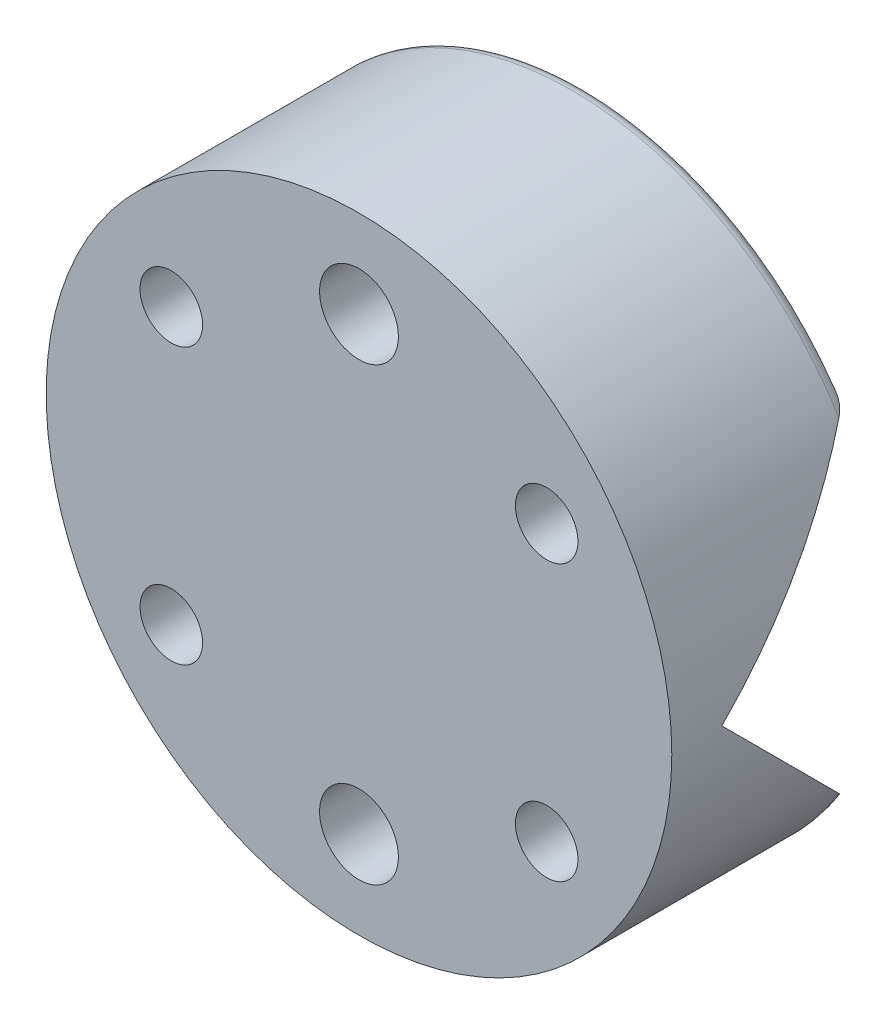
ISO-10303-21;
HEADER;
FILE_DESCRIPTION(('STEP AP214'),'2;1');
FILE_NAME('part.step','',(''),(''),'','','');
FILE_SCHEMA(('AUTOMOTIVE_DESIGN { 1 0 10303 214 1 1 1 1 }'));
ENDSEC;
DATA;
#1=APPLICATION_CONTEXT('core data for automotive mechanical design processes');
#2=APPLICATION_PROTOCOL_DEFINITION('international standard','automotive_design',2000,#1);
#3=PRODUCT_CONTEXT('',#1,'mechanical');
#4=PRODUCT('Part','Part','',(#3));
#5=PRODUCT_RELATED_PRODUCT_CATEGORY('part','',(#4));
#6=PRODUCT_DEFINITION_FORMATION('','',#4);
#7=PRODUCT_DEFINITION_CONTEXT('part definition',#1,'design');
#8=PRODUCT_DEFINITION('design','',#6,#7);
#9=PRODUCT_DEFINITION_SHAPE('','',#8);
#10=(LENGTH_UNIT() NAMED_UNIT(*) SI_UNIT(.MILLI.,.METRE.));
#11=(NAMED_UNIT(*) PLANE_ANGLE_UNIT() SI_UNIT($,.RADIAN.));
#12=(NAMED_UNIT(*) SI_UNIT($,.STERADIAN.) SOLID_ANGLE_UNIT());
#13=UNCERTAINTY_MEASURE_WITH_UNIT(LENGTH_MEASURE(1.E-05),#10,'distance_accuracy_value','');
#14=(GEOMETRIC_REPRESENTATION_CONTEXT(3) GLOBAL_UNCERTAINTY_ASSIGNED_CONTEXT((#13)) GLOBAL_UNIT_ASSIGNED_CONTEXT((#10,
#11,#12)) REPRESENTATION_CONTEXT('',''));
#15=CARTESIAN_POINT('',(0.,0.,0.));
#16=DIRECTION('',(0.,0.,1.));
#17=DIRECTION('',(1.,0.,0.));
#18=AXIS2_PLACEMENT_3D('',#15,#16,#17);
#19=CARTESIAN_POINT('',(0.,0.,0.));
#20=DIRECTION('',(0.,0.,1.));
#21=DIRECTION('',(1.,0.,0.));
#22=AXIS2_PLACEMENT_3D('',#19,#20,#21);
#23=PLANE('',#22);
#24=CARTESIAN_POINT('',(0.,18.,0.));
#25=DIRECTION('',(0.,0.,1.));
#26=DIRECTION('',(1.,0.,0.));
#27=AXIS2_PLACEMENT_3D('',#24,#25,#26);
#28=CIRCLE('',#27,3.15);
#29=CARTESIAN_POINT('',(3.15,18.,0.));
#30=VERTEX_POINT('',#29);
#31=EDGE_CURVE('E241',#30,#30,#28,.T.);
#32=ORIENTED_EDGE('',*,*,#31,.T.);
#33=EDGE_LOOP('',(#32));
#34=FACE_BOUND('',#33,.T.);
#35=DIRECTION('',(-1.,0.,0.));
#36=VECTOR('',#35,1.);
#37=CARTESIAN_POINT('',(0.,14.,0.));
#38=LINE('',#37,#36);
#39=CARTESIAN_POINT('',(19.4935886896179,14.,0.));
#40=VERTEX_POINT('',#39);
#41=CARTESIAN_POINT('',(-19.4935886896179,14.,0.));
#42=VERTEX_POINT('',#41);
#43=EDGE_CURVE('E144',#40,#42,#38,.T.);
#44=ORIENTED_EDGE('',*,*,#43,.T.);
#45=CARTESIAN_POINT('',(0.,0.,0.));
#46=DIRECTION('',(0.,0.,1.));
#47=DIRECTION('',(1.,0.,0.));
#48=AXIS2_PLACEMENT_3D('',#45,#46,#47);
#49=CIRCLE('',#48,24.);
#50=EDGE_CURVE('E11',#42,#40,#49,.F.);
#51=ORIENTED_EDGE('',*,*,#50,.T.);
#52=EDGE_LOOP('',(#44,#51));
#53=FACE_BOUND('',#52,.T.);
#54=ADVANCED_FACE('F33',(#34,#53),#23,.F.);
#55=CARTESIAN_POINT('',(0.,0.,18.));
#56=DIRECTION('',(0.,0.,-1.));
#57=DIRECTION('',(-1.,0.,0.));
#58=AXIS2_PLACEMENT_3D('',#55,#56,#57);
#59=CYLINDRICAL_SURFACE('',#58,25.);
#60=CARTESIAN_POINT('',(0.,0.,18.));
#61=DIRECTION('',(0.,0.,1.));
#62=DIRECTION('',(1.,0.,0.));
#63=AXIS2_PLACEMENT_3D('',#60,#61,#62);
#64=CIRCLE('',#63,25.);
#65=CARTESIAN_POINT('',(25.,0.,18.));
#66=VERTEX_POINT('',#65);
#67=EDGE_CURVE('E138',#66,#66,#64,.T.);
#68=ORIENTED_EDGE('',*,*,#67,.F.);
#69=EDGE_LOOP('',(#68));
#70=FACE_BOUND('',#69,.T.);
#71=CARTESIAN_POINT('',(0.,0.,14.));
#72=DIRECTION('',(0.,-0.707106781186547,0.707106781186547));
#73=DIRECTION('',(0.,-0.707106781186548,-0.707106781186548));
#74=AXIS2_PLACEMENT_3D('',#71,#72,#73);
#75=ELLIPSE('',#74,35.3553390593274,25.);
#76=CARTESIAN_POINT('',(-25.,0.,14.));
#77=VERTEX_POINT('',#76);
#78=CARTESIAN_POINT('',(-21.3541565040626,-13.,0.999999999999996));
#79=VERTEX_POINT('',#78);
#80=EDGE_CURVE('E133',#77,#79,#75,.T.);
#81=ORIENTED_EDGE('',*,*,#80,.T.);
#82=CARTESIAN_POINT('',(0.,0.,1.));
#83=DIRECTION('',(0.,0.,1.));
#84=DIRECTION('',(1.,0.,0.));
#85=AXIS2_PLACEMENT_3D('',#82,#83,#84);
#86=CIRCLE('',#85,25.);
#87=CARTESIAN_POINT('',(21.3541565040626,-13.,0.999999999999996));
#88=VERTEX_POINT('',#87);
#89=EDGE_CURVE('E149',#79,#88,#86,.T.);
#90=ORIENTED_EDGE('',*,*,#89,.T.);
#91=CARTESIAN_POINT('',(0.,0.,14.));
#92=DIRECTION('',(0.,-0.707106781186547,0.707106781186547));
#93=DIRECTION('',(0.,-0.707106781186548,-0.707106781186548));
#94=AXIS2_PLACEMENT_3D('',#91,#92,#93);
#95=ELLIPSE('',#94,35.3553390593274,25.);
#96=CARTESIAN_POINT('',(25.,0.,14.));
#97=VERTEX_POINT('',#96);
#98=EDGE_CURVE('E125',#88,#97,#95,.T.);
#99=ORIENTED_EDGE('',*,*,#98,.T.);
#100=CARTESIAN_POINT('',(0.,0.,14.));
#101=DIRECTION('',(0.,0.707106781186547,0.707106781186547));
#102=DIRECTION('',(0.,0.707106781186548,-0.707106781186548));
#103=AXIS2_PLACEMENT_3D('',#100,#101,#102);
#104=ELLIPSE('',#103,35.3553390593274,25.);
#105=CARTESIAN_POINT('',(21.3541565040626,13.,0.999999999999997));
#106=VERTEX_POINT('',#105);
#107=EDGE_CURVE('E127',#97,#106,#104,.T.);
#108=ORIENTED_EDGE('',*,*,#107,.T.);
#109=CARTESIAN_POINT('',(0.,0.,1.));
#110=DIRECTION('',(0.,0.,1.));
#111=DIRECTION('',(1.,0.,0.));
#112=AXIS2_PLACEMENT_3D('',#109,#110,#111);
#113=CIRCLE('',#112,25.);
#114=CARTESIAN_POINT('',(-21.3541565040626,13.,0.999999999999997));
#115=VERTEX_POINT('',#114);
#116=EDGE_CURVE('E146',#106,#115,#113,.T.);
#117=ORIENTED_EDGE('',*,*,#116,.T.);
#118=CARTESIAN_POINT('',(0.,0.,14.));
#119=DIRECTION('',(0.,0.707106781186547,0.707106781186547));
#120=DIRECTION('',(0.,0.707106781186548,-0.707106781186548));
#121=AXIS2_PLACEMENT_3D('',#118,#119,#120);
#122=ELLIPSE('',#121,35.3553390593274,25.);
#123=EDGE_CURVE('E136',#115,#77,#122,.T.);
#124=ORIENTED_EDGE('',*,*,#123,.T.);
#125=EDGE_LOOP('',(#81,#90,#99,#108,#117,#124));
#126=FACE_BOUND('',#125,.T.);
#127=ADVANCED_FACE('F35',(#70,#126),#59,.T.);
#128=CARTESIAN_POINT('',(0.,0.,18.));
#129=DIRECTION('',(0.,0.,1.));
#130=DIRECTION('',(1.,0.,0.));
#131=AXIS2_PLACEMENT_3D('',#128,#129,#130);
#132=PLANE('',#131);
#133=CARTESIAN_POINT('',(0.,18.,18.));
#134=DIRECTION('',(0.,0.,1.));
#135=DIRECTION('',(1.,0.,0.));
#136=AXIS2_PLACEMENT_3D('',#133,#134,#135);
#137=CIRCLE('',#136,3.15);
#138=CARTESIAN_POINT('',(3.15,18.,18.));
#139=VERTEX_POINT('',#138);
#140=EDGE_CURVE('E242',#139,#139,#137,.T.);
#141=ORIENTED_EDGE('',*,*,#140,.F.);
#142=EDGE_LOOP('',(#141));
#143=FACE_BOUND('',#142,.T.);
#144=CARTESIAN_POINT('',(0.,-18.,18.));
#145=DIRECTION('',(0.,0.,1.));
#146=DIRECTION('',(1.,0.,0.));
#147=AXIS2_PLACEMENT_3D('',#144,#145,#146);
#148=CIRCLE('',#147,3.15);
#149=CARTESIAN_POINT('',(3.15,-18.,18.));
#150=VERTEX_POINT('',#149);
#151=EDGE_CURVE('E104',#150,#150,#148,.T.);
#152=ORIENTED_EDGE('',*,*,#151,.F.);
#153=EDGE_LOOP('',(#152));
#154=FACE_BOUND('',#153,.T.);
#155=CARTESIAN_POINT('',(-15.,-11.,18.));
#156=DIRECTION('',(0.,0.,1.));
#157=DIRECTION('',(1.,0.,0.));
#158=AXIS2_PLACEMENT_3D('',#155,#156,#157);
#159=CIRCLE('',#158,2.5);
#160=CARTESIAN_POINT('',(-12.5,-11.,18.));
#161=VERTEX_POINT('',#160);
#162=EDGE_CURVE('E110',#161,#161,#159,.T.);
#163=ORIENTED_EDGE('',*,*,#162,.F.);
#164=EDGE_LOOP('',(#163));
#165=FACE_BOUND('',#164,.T.);
#166=CARTESIAN_POINT('',(-15.,11.,18.));
#167=DIRECTION('',(0.,0.,1.));
#168=DIRECTION('',(1.,0.,0.));
#169=AXIS2_PLACEMENT_3D('',#166,#167,#168);
#170=CIRCLE('',#169,2.5);
#171=CARTESIAN_POINT('',(-12.5,11.,18.));
#172=VERTEX_POINT('',#171);
#173=EDGE_CURVE('E113',#172,#172,#170,.T.);
#174=ORIENTED_EDGE('',*,*,#173,.F.);
#175=EDGE_LOOP('',(#174));
#176=FACE_BOUND('',#175,.T.);
#177=CARTESIAN_POINT('',(15.,-11.,18.));
#178=DIRECTION('',(0.,0.,1.));
#179=DIRECTION('',(1.,0.,0.));
#180=AXIS2_PLACEMENT_3D('',#177,#178,#179);
#181=CIRCLE('',#180,2.5);
#182=CARTESIAN_POINT('',(17.5,-11.,18.));
#183=VERTEX_POINT('',#182);
#184=EDGE_CURVE('E116',#183,#183,#181,.T.);
#185=ORIENTED_EDGE('',*,*,#184,.F.);
#186=EDGE_LOOP('',(#185));
#187=FACE_BOUND('',#186,.T.);
#188=CARTESIAN_POINT('',(15.,11.,18.));
#189=DIRECTION('',(0.,0.,1.));
#190=DIRECTION('',(1.,0.,0.));
#191=AXIS2_PLACEMENT_3D('',#188,#189,#190);
#192=CIRCLE('',#191,2.5);
#193=CARTESIAN_POINT('',(17.5,11.,18.));
#194=VERTEX_POINT('',#193);
#195=EDGE_CURVE('E122',#194,#194,#192,.T.);
#196=ORIENTED_EDGE('',*,*,#195,.F.);
#197=EDGE_LOOP('',(#196));
#198=FACE_BOUND('',#197,.T.);
#199=ORIENTED_EDGE('',*,*,#67,.T.);
#200=EDGE_LOOP('',(#199));
#201=FACE_BOUND('',#200,.T.);
#202=ADVANCED_FACE('F212',(#143,#154,#165,#176,#187,#198,#201),#132,.T.);
#203=CARTESIAN_POINT('',(0.,-18.,0.));
#204=DIRECTION('',(0.,0.,1.));
#205=DIRECTION('',(1.,0.,0.));
#206=AXIS2_PLACEMENT_3D('',#203,#204,#205);
#207=CIRCLE('',#206,3.15);
#208=CARTESIAN_POINT('',(3.15,-18.,0.));
#209=VERTEX_POINT('',#208);
#210=EDGE_CURVE('E98',#209,#209,#207,.T.);
#211=ORIENTED_EDGE('',*,*,#210,.T.);
#212=EDGE_LOOP('',(#211));
#213=FACE_BOUND('',#212,.T.);
#214=DIRECTION('',(1.,0.,0.));
#215=VECTOR('',#214,1.);
#216=CARTESIAN_POINT('',(0.,-14.,0.));
#217=LINE('',#216,#215);
#218=CARTESIAN_POINT('',(-19.4935886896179,-14.,0.));
#219=VERTEX_POINT('',#218);
#220=CARTESIAN_POINT('',(19.4935886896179,-14.,0.));
#221=VERTEX_POINT('',#220);
#222=EDGE_CURVE('E141',#219,#221,#217,.T.);
#223=ORIENTED_EDGE('',*,*,#222,.T.);
#224=CARTESIAN_POINT('',(0.,0.,0.));
#225=DIRECTION('',(0.,0.,1.));
#226=DIRECTION('',(1.,0.,0.));
#227=AXIS2_PLACEMENT_3D('',#224,#225,#226);
#228=CIRCLE('',#227,24.);
#229=EDGE_CURVE('E225',#221,#219,#228,.F.);
#230=ORIENTED_EDGE('',*,*,#229,.T.);
#231=EDGE_LOOP('',(#223,#230));
#232=FACE_BOUND('',#231,.T.);
#233=ADVANCED_FACE('F183',(#213,#232),#23,.F.);
#234=CARTESIAN_POINT('',(-25.,14.,0.));
#235=DIRECTION('',(0.,0.707106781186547,0.707106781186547));
#236=DIRECTION('',(0.,-0.707106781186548,0.707106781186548));
#237=AXIS2_PLACEMENT_3D('',#234,#235,#236);
#238=PLANE('',#237);
#239=ORIENTED_EDGE('',*,*,#123,.F.);
#240=CARTESIAN_POINT('',(-21.3541565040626,13.,1.));
#241=CARTESIAN_POINT('',(-21.3281749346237,13.0426274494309,0.957372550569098));
#242=CARTESIAN_POINT('',(-21.2994248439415,13.0843766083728,0.915623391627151));
#243=CARTESIAN_POINT('',(-21.2370046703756,13.1659499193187,0.834050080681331));
#244=CARTESIAN_POINT('',(-21.2033390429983,13.2057757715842,0.794224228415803));
#245=CARTESIAN_POINT('',(-21.1316564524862,13.2834107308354,0.716589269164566));
#246=CARTESIAN_POINT('',(-21.0936395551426,13.3212198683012,0.678780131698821));
#247=CARTESIAN_POINT('',(-21.0136691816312,13.3946904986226,0.605309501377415));
#248=CARTESIAN_POINT('',(-20.9717146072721,13.4303513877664,0.569648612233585));
#249=CARTESIAN_POINT('',(-20.8373042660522,13.5363809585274,0.463619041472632));
#250=CARTESIAN_POINT('',(-20.7388417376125,13.6030633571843,0.396936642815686));
#251=CARTESIAN_POINT('',(-20.5811490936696,13.6943682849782,0.305631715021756));
#252=CARTESIAN_POINT('',(-20.526855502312,13.7233762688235,0.276623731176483));
#253=CARTESIAN_POINT('',(-20.4150845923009,13.7781424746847,0.221857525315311));
#254=CARTESIAN_POINT('',(-20.3576084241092,13.8039018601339,0.196098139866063));
#255=CARTESIAN_POINT('',(-20.2185784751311,13.8602707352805,0.139729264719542));
#256=CARTESIAN_POINT('',(-20.1357504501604,13.8893317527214,0.110668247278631));
#257=CARTESIAN_POINT('',(-19.9654557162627,13.9388540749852,0.0611459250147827));
#258=CARTESIAN_POINT('',(-19.8780170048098,13.9593617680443,0.040638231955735));
#259=CARTESIAN_POINT('',(-19.7404698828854,13.9822966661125,0.0177033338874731));
#260=CARTESIAN_POINT('',(-19.6916988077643,13.9887013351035,0.0112986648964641));
#261=CARTESIAN_POINT('',(-19.5931999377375,13.9975447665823,0.00245523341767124));
#262=CARTESIAN_POINT('',(-19.5434684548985,13.9999624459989,3.75540011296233E-05));
#263=CARTESIAN_POINT('',(-19.4935886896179,14.,0.));
#264=B_SPLINE_CURVE_WITH_KNOTS('',3,(#240,#241,#242,#243,#244,#245,#246,#247,#248,#249,#250,
#251,#252,#253,#254,#255,#256,#257,#258,#259,#260,#261,#262,#263),.UNSPECIFIED.,.F.,.F.,(4,2,2,
2,2,2,2,2,2,2,2,4),(0.,0.196797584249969,0.393417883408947,0.590035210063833,0.78670753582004,
1.19379782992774,1.3977760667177,1.60168104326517,1.87833417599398,2.15346675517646,
2.30199214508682,2.45130044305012),.UNSPECIFIED.);
#265=EDGE_CURVE('E41',#115,#42,#264,.T.);
#266=ORIENTED_EDGE('',*,*,#265,.T.);
#267=ORIENTED_EDGE('',*,*,#43,.F.);
#268=CARTESIAN_POINT('',(19.4935886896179,14.,0.));
#269=CARTESIAN_POINT('',(19.5366338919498,13.9999779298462,2.20701537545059E-05));
#270=CARTESIAN_POINT('',(19.5796006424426,13.9981688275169,0.00183117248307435));
#271=CARTESIAN_POINT('',(19.6649379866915,13.991475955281,0.00852404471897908));
#272=CARTESIAN_POINT('',(19.7073099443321,13.9866010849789,0.0133989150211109));
#273=CARTESIAN_POINT('',(19.7908518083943,13.974331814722,0.0256681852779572));
#274=CARTESIAN_POINT('',(19.8320294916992,13.9669630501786,0.0330369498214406));
#275=CARTESIAN_POINT('',(19.9135038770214,13.9500279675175,0.0499720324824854));
#276=CARTESIAN_POINT('',(19.9537996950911,13.9404595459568,0.0595404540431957));
#277=CARTESIAN_POINT('',(20.0500429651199,13.914991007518,0.0850089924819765));
#278=CARTESIAN_POINT('',(20.1054769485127,13.8981174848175,0.101882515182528));
#279=CARTESIAN_POINT('',(20.2141172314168,13.8610801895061,0.138919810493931));
#280=CARTESIAN_POINT('',(20.2673217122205,13.840913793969,0.159086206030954));
#281=CARTESIAN_POINT('',(20.4239596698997,13.775880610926,0.224119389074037));
#282=CARTESIAN_POINT('',(20.5238196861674,13.7266468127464,0.273353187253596));
#283=CARTESIAN_POINT('',(20.7170671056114,13.6164862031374,0.38351379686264));
#284=CARTESIAN_POINT('',(20.8099612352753,13.5551330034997,0.44486699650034));
#285=CARTESIAN_POINT('',(20.9822421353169,13.4239716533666,0.576028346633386));
#286=CARTESIAN_POINT('',(21.0616811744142,13.3541981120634,0.645801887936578));
#287=CARTESIAN_POINT('',(21.1762709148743,13.2365250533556,0.763474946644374));
#288=CARTESIAN_POINT('',(21.2164265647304,13.1910399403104,0.808960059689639));
#289=CARTESIAN_POINT('',(21.2903376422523,13.0974370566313,0.902562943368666));
#290=CARTESIAN_POINT('',(21.3240810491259,13.0493145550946,0.950685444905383));
#291=CARTESIAN_POINT('',(21.3541565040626,13.,1.));
#292=B_SPLINE_CURVE_WITH_KNOTS('',3,(#268,#269,#270,#271,#272,#273,#274,#275,#276,#277,#278,
#279,#280,#281,#282,#283,#284,#285,#286,#287,#288,#289,#290,#291),.UNSPECIFIED.,.F.,.F.,(4,2,2,
2,2,2,2,2,2,2,2,4),(0.,0.128950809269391,0.257529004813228,0.384823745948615,0.512240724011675,
0.693025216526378,0.873954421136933,1.23771959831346,1.61784925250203,1.99646655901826,
2.22363418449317,2.45122355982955),.UNSPECIFIED.);
#293=EDGE_CURVE('E186',#40,#106,#292,.T.);
#294=ORIENTED_EDGE('',*,*,#293,.T.);
#295=ORIENTED_EDGE('',*,*,#107,.F.);
#296=DIRECTION('',(1.,0.,0.));
#297=VECTOR('',#296,1.);
#298=CARTESIAN_POINT('',(-25.,0.,14.));
#299=LINE('',#298,#297);
#300=EDGE_CURVE('E130',#77,#97,#299,.T.);
#301=ORIENTED_EDGE('',*,*,#300,.F.);
#302=EDGE_LOOP('',(#239,#266,#267,#294,#295,#301));
#303=FACE_BOUND('',#302,.T.);
#304=ADVANCED_FACE('F176',(#303),#238,.F.);
#305=CARTESIAN_POINT('',(-25.,0.,14.));
#306=DIRECTION('',(0.,-0.707106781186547,0.707106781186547));
#307=DIRECTION('',(0.,-0.707106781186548,-0.707106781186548));
#308=AXIS2_PLACEMENT_3D('',#305,#306,#307);
#309=PLANE('',#308);
#310=ORIENTED_EDGE('',*,*,#98,.F.);
#311=CARTESIAN_POINT('',(21.3541565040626,-13.,1.));
#312=CARTESIAN_POINT('',(21.3281749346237,-13.0426274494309,0.957372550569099));
#313=CARTESIAN_POINT('',(21.2994248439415,-13.0843766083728,0.915623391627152));
#314=CARTESIAN_POINT('',(21.2370046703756,-13.1659499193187,0.834050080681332));
#315=CARTESIAN_POINT('',(21.2033390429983,-13.2057757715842,0.794224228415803));
#316=CARTESIAN_POINT('',(21.1316564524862,-13.2834107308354,0.716589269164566));
#317=CARTESIAN_POINT('',(21.0936395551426,-13.3212198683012,0.678780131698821));
#318=CARTESIAN_POINT('',(21.0136691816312,-13.3946904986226,0.605309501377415));
#319=CARTESIAN_POINT('',(20.9717146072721,-13.4303513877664,0.569648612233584));
#320=CARTESIAN_POINT('',(20.8373042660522,-13.5363809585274,0.46361904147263));
#321=CARTESIAN_POINT('',(20.7388417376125,-13.6030633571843,0.396936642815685));
#322=CARTESIAN_POINT('',(20.5811490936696,-13.6943682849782,0.305631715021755));
#323=CARTESIAN_POINT('',(20.526855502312,-13.7233762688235,0.276623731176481));
#324=CARTESIAN_POINT('',(20.4150845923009,-13.7781424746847,0.221857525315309));
#325=CARTESIAN_POINT('',(20.3576084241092,-13.8039018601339,0.196098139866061));
#326=CARTESIAN_POINT('',(20.2185784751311,-13.8602707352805,0.139729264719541));
#327=CARTESIAN_POINT('',(20.1357504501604,-13.8893317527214,0.110668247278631));
#328=CARTESIAN_POINT('',(19.9654557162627,-13.9388540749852,0.0611459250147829));
#329=CARTESIAN_POINT('',(19.8780170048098,-13.9593617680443,0.0406382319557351));
#330=CARTESIAN_POINT('',(19.7404698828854,-13.9822966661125,0.0177033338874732));
#331=CARTESIAN_POINT('',(19.6916988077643,-13.9887013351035,0.0112986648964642));
#332=CARTESIAN_POINT('',(19.5931999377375,-13.9975447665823,0.00245523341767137));
#333=CARTESIAN_POINT('',(19.5434684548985,-13.9999624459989,3.75540011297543E-05));
#334=CARTESIAN_POINT('',(19.4935886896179,-14.,0.));
#335=B_SPLINE_CURVE_WITH_KNOTS('',3,(#311,#312,#313,#314,#315,#316,#317,#318,#319,#320,#321,
#322,#323,#324,#325,#326,#327,#328,#329,#330,#331,#332,#333,#334),.UNSPECIFIED.,.F.,.F.,(4,2,2,
2,2,2,2,2,2,2,2,4),(0.,0.196797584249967,0.393417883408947,0.590035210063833,0.786707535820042,
1.19379782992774,1.3977760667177,1.60168104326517,1.87833417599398,2.15346675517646,
2.30199214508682,2.45130044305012),.UNSPECIFIED.);
#336=EDGE_CURVE('E160',#88,#221,#335,.T.);
#337=ORIENTED_EDGE('',*,*,#336,.T.);
#338=ORIENTED_EDGE('',*,*,#222,.F.);
#339=CARTESIAN_POINT('',(-19.4935886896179,-14.,0.));
#340=CARTESIAN_POINT('',(-19.5366338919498,-13.9999779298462,2.20701537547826E-05));
#341=CARTESIAN_POINT('',(-19.5796006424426,-13.9981688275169,0.00183117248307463));
#342=CARTESIAN_POINT('',(-19.6649379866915,-13.991475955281,0.00852404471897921));
#343=CARTESIAN_POINT('',(-19.7073099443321,-13.9866010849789,0.0133989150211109));
#344=CARTESIAN_POINT('',(-19.7908518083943,-13.974331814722,0.0256681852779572));
#345=CARTESIAN_POINT('',(-19.8320294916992,-13.9669630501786,0.0330369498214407));
#346=CARTESIAN_POINT('',(-19.9135038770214,-13.9500279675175,0.0499720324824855));
#347=CARTESIAN_POINT('',(-19.9537996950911,-13.9404595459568,0.0595404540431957));
#348=CARTESIAN_POINT('',(-20.0500429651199,-13.914991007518,0.0850089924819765));
#349=CARTESIAN_POINT('',(-20.1054769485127,-13.8981174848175,0.101882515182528));
#350=CARTESIAN_POINT('',(-20.2141172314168,-13.8610801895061,0.138919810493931));
#351=CARTESIAN_POINT('',(-20.2673217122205,-13.840913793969,0.159086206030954));
#352=CARTESIAN_POINT('',(-20.4239596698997,-13.775880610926,0.224119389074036));
#353=CARTESIAN_POINT('',(-20.5238196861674,-13.7266468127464,0.273353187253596));
#354=CARTESIAN_POINT('',(-20.7170671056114,-13.6164862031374,0.38351379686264));
#355=CARTESIAN_POINT('',(-20.8099612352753,-13.5551330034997,0.444866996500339));
#356=CARTESIAN_POINT('',(-20.9822421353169,-13.4239716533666,0.576028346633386));
#357=CARTESIAN_POINT('',(-21.0616811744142,-13.3541981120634,0.64580188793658));
#358=CARTESIAN_POINT('',(-21.1762709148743,-13.2365250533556,0.763474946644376));
#359=CARTESIAN_POINT('',(-21.2164265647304,-13.1910399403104,0.808960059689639));
#360=CARTESIAN_POINT('',(-21.2903376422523,-13.0974370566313,0.902562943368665));
#361=CARTESIAN_POINT('',(-21.3240810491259,-13.0493145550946,0.950685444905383));
#362=CARTESIAN_POINT('',(-21.3541565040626,-13.,1.));
#363=B_SPLINE_CURVE_WITH_KNOTS('',3,(#339,#340,#341,#342,#343,#344,#345,#346,#347,#348,#349,
#350,#351,#352,#353,#354,#355,#356,#357,#358,#359,#360,#361,#362),.UNSPECIFIED.,.F.,.F.,(4,2,2,
2,2,2,2,2,2,2,2,4),(0.,0.128950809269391,0.257529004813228,0.384823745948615,0.512240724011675,
0.693025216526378,0.873954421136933,1.23771959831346,1.61784925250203,1.99646655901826,
2.22363418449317,2.45122355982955),.UNSPECIFIED.);
#364=EDGE_CURVE('E152',#219,#79,#363,.T.);
#365=ORIENTED_EDGE('',*,*,#364,.T.);
#366=ORIENTED_EDGE('',*,*,#80,.F.);
#367=ORIENTED_EDGE('',*,*,#300,.T.);
#368=EDGE_LOOP('',(#310,#337,#338,#365,#366,#367));
#369=FACE_BOUND('',#368,.T.);
#370=ADVANCED_FACE('F170',(#369),#309,.F.);
#371=CARTESIAN_POINT('',(15.,11.,8.00000000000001));
#372=DIRECTION('',(0.,0.,1.));
#373=DIRECTION('',(1.,0.,0.));
#374=AXIS2_PLACEMENT_3D('',#371,#372,#373);
#375=CYLINDRICAL_SURFACE('',#374,2.5);
#376=CARTESIAN_POINT('',(15.,11.,8.00000000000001));
#377=DIRECTION('',(0.,0.,1.));
#378=DIRECTION('',(1.,0.,0.));
#379=AXIS2_PLACEMENT_3D('',#376,#377,#378);
#380=CIRCLE('',#379,2.5);
#381=CARTESIAN_POINT('',(17.5,11.,8.00000000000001));
#382=VERTEX_POINT('',#381);
#383=EDGE_CURVE('E119',#382,#382,#380,.T.);
#384=ORIENTED_EDGE('',*,*,#383,.F.);
#385=EDGE_LOOP('',(#384));
#386=FACE_BOUND('',#385,.T.);
#387=ORIENTED_EDGE('',*,*,#195,.T.);
#388=EDGE_LOOP('',(#387));
#389=FACE_BOUND('',#388,.T.);
#390=ADVANCED_FACE('F175',(#386,#389),#375,.F.);
#391=CARTESIAN_POINT('',(15.,11.,8.00000000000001));
#392=DIRECTION('',(0.,0.,1.));
#393=DIRECTION('',(1.,0.,0.));
#394=AXIS2_PLACEMENT_3D('',#391,#392,#393);
#395=CONICAL_SURFACE('',#394,2.5,1.0471975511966);
#396=CARTESIAN_POINT('',(15.,11.,6.55662432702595));
#397=VERTEX_POINT('',#396);
#398=VERTEX_LOOP('',#397);
#399=FACE_BOUND('',#398,.T.);
#400=ORIENTED_EDGE('',*,*,#383,.T.);
#401=EDGE_LOOP('',(#400));
#402=FACE_BOUND('',#401,.T.);
#403=ADVANCED_FACE('F260',(#399,#402),#395,.F.);
#404=CARTESIAN_POINT('',(15.,-11.,8.00000000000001));
#405=DIRECTION('',(0.,0.,1.));
#406=DIRECTION('',(1.,0.,0.));
#407=AXIS2_PLACEMENT_3D('',#404,#405,#406);
#408=CYLINDRICAL_SURFACE('',#407,2.5);
#409=CARTESIAN_POINT('',(15.,-11.,8.00000000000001));
#410=DIRECTION('',(0.,0.,1.));
#411=DIRECTION('',(1.,0.,0.));
#412=AXIS2_PLACEMENT_3D('',#409,#410,#411);
#413=CIRCLE('',#412,2.5);
#414=CARTESIAN_POINT('',(17.5,-11.,8.00000000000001));
#415=VERTEX_POINT('',#414);
#416=EDGE_CURVE('E95',#415,#415,#413,.T.);
#417=ORIENTED_EDGE('',*,*,#416,.F.);
#418=EDGE_LOOP('',(#417));
#419=FACE_BOUND('',#418,.T.);
#420=ORIENTED_EDGE('',*,*,#184,.T.);
#421=EDGE_LOOP('',(#420));
#422=FACE_BOUND('',#421,.T.);
#423=ADVANCED_FACE('F265',(#419,#422),#408,.F.);
#424=CARTESIAN_POINT('',(-15.,11.,8.00000000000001));
#425=DIRECTION('',(0.,0.,1.));
#426=DIRECTION('',(1.,0.,0.));
#427=AXIS2_PLACEMENT_3D('',#424,#425,#426);
#428=CYLINDRICAL_SURFACE('',#427,2.5);
#429=CARTESIAN_POINT('',(-15.,11.,8.00000000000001));
#430=DIRECTION('',(0.,0.,1.));
#431=DIRECTION('',(1.,0.,0.));
#432=AXIS2_PLACEMENT_3D('',#429,#430,#431);
#433=CIRCLE('',#432,2.5);
#434=CARTESIAN_POINT('',(-12.5,11.,8.00000000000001));
#435=VERTEX_POINT('',#434);
#436=EDGE_CURVE('E101',#435,#435,#433,.T.);
#437=ORIENTED_EDGE('',*,*,#436,.F.);
#438=EDGE_LOOP('',(#437));
#439=FACE_BOUND('',#438,.T.);
#440=ORIENTED_EDGE('',*,*,#173,.T.);
#441=EDGE_LOOP('',(#440));
#442=FACE_BOUND('',#441,.T.);
#443=ADVANCED_FACE('F272',(#439,#442),#428,.F.);
#444=CARTESIAN_POINT('',(-15.,-11.,8.00000000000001));
#445=DIRECTION('',(0.,0.,1.));
#446=DIRECTION('',(1.,0.,0.));
#447=AXIS2_PLACEMENT_3D('',#444,#445,#446);
#448=CYLINDRICAL_SURFACE('',#447,2.5);
#449=CARTESIAN_POINT('',(-15.,-11.,8.00000000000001));
#450=DIRECTION('',(0.,0.,1.));
#451=DIRECTION('',(1.,0.,0.));
#452=AXIS2_PLACEMENT_3D('',#449,#450,#451);
#453=CIRCLE('',#452,2.5);
#454=CARTESIAN_POINT('',(-12.5,-11.,8.00000000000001));
#455=VERTEX_POINT('',#454);
#456=EDGE_CURVE('E97',#455,#455,#453,.T.);
#457=ORIENTED_EDGE('',*,*,#456,.F.);
#458=EDGE_LOOP('',(#457));
#459=FACE_BOUND('',#458,.T.);
#460=ORIENTED_EDGE('',*,*,#162,.T.);
#461=EDGE_LOOP('',(#460));
#462=FACE_BOUND('',#461,.T.);
#463=ADVANCED_FACE('F277',(#459,#462),#448,.F.);
#464=CARTESIAN_POINT('',(-15.,11.,8.00000000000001));
#465=DIRECTION('',(0.,0.,1.));
#466=DIRECTION('',(1.,0.,0.));
#467=AXIS2_PLACEMENT_3D('',#464,#465,#466);
#468=CONICAL_SURFACE('',#467,2.5,1.0471975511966);
#469=CARTESIAN_POINT('',(-15.,11.,6.55662432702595));
#470=VERTEX_POINT('',#469);
#471=VERTEX_LOOP('',#470);
#472=FACE_BOUND('',#471,.T.);
#473=ORIENTED_EDGE('',*,*,#436,.T.);
#474=EDGE_LOOP('',(#473));
#475=FACE_BOUND('',#474,.T.);
#476=ADVANCED_FACE('F281',(#472,#475),#468,.F.);
#477=CARTESIAN_POINT('',(-15.,-11.,8.00000000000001));
#478=DIRECTION('',(0.,0.,1.));
#479=DIRECTION('',(1.,0.,0.));
#480=AXIS2_PLACEMENT_3D('',#477,#478,#479);
#481=CONICAL_SURFACE('',#480,2.5,1.0471975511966);
#482=CARTESIAN_POINT('',(-15.,-11.,6.55662432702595));
#483=VERTEX_POINT('',#482);
#484=VERTEX_LOOP('',#483);
#485=FACE_BOUND('',#484,.T.);
#486=ORIENTED_EDGE('',*,*,#456,.T.);
#487=EDGE_LOOP('',(#486));
#488=FACE_BOUND('',#487,.T.);
#489=ADVANCED_FACE('F91',(#485,#488),#481,.F.);
#490=CARTESIAN_POINT('',(15.,-11.,8.00000000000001));
#491=DIRECTION('',(0.,0.,1.));
#492=DIRECTION('',(1.,0.,0.));
#493=AXIS2_PLACEMENT_3D('',#490,#491,#492);
#494=CONICAL_SURFACE('',#493,2.5,1.0471975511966);
#495=CARTESIAN_POINT('',(15.,-11.,6.55662432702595));
#496=VERTEX_POINT('',#495);
#497=VERTEX_LOOP('',#496);
#498=FACE_BOUND('',#497,.T.);
#499=ORIENTED_EDGE('',*,*,#416,.T.);
#500=EDGE_LOOP('',(#499));
#501=FACE_BOUND('',#500,.T.);
#502=ADVANCED_FACE('F87',(#498,#501),#494,.F.);
#503=CARTESIAN_POINT('',(0.,-18.,0.));
#504=DIRECTION('',(0.,0.,1.));
#505=DIRECTION('',(1.,0.,0.));
#506=AXIS2_PLACEMENT_3D('',#503,#504,#505);
#507=CYLINDRICAL_SURFACE('',#506,3.15);
#508=ORIENTED_EDGE('',*,*,#210,.F.);
#509=EDGE_LOOP('',(#508));
#510=FACE_BOUND('',#509,.T.);
#511=ORIENTED_EDGE('',*,*,#151,.T.);
#512=EDGE_LOOP('',(#511));
#513=FACE_BOUND('',#512,.T.);
#514=ADVANCED_FACE('F90',(#510,#513),#507,.F.);
#515=CARTESIAN_POINT('',(0.,18.,0.));
#516=DIRECTION('',(0.,0.,1.));
#517=DIRECTION('',(1.,0.,0.));
#518=AXIS2_PLACEMENT_3D('',#515,#516,#517);
#519=CYLINDRICAL_SURFACE('',#518,3.15);
#520=ORIENTED_EDGE('',*,*,#31,.F.);
#521=EDGE_LOOP('',(#520));
#522=FACE_BOUND('',#521,.T.);
#523=ORIENTED_EDGE('',*,*,#140,.T.);
#524=EDGE_LOOP('',(#523));
#525=FACE_BOUND('',#524,.T.);
#526=ADVANCED_FACE('F203',(#522,#525),#519,.F.);
#527=CARTESIAN_POINT('',(0.,0.,1.));
#528=DIRECTION('',(0.,0.,1.));
#529=DIRECTION('',(1.,0.,0.));
#530=AXIS2_PLACEMENT_3D('',#527,#528,#529);
#531=TOROIDAL_SURFACE('',#530,24.,1.);
#532=ORIENTED_EDGE('',*,*,#364,.F.);
#533=ORIENTED_EDGE('',*,*,#229,.F.);
#534=ORIENTED_EDGE('',*,*,#336,.F.);
#535=ORIENTED_EDGE('',*,*,#89,.F.);
#536=EDGE_LOOP('',(#532,#533,#534,#535));
#537=FACE_BOUND('',#536,.T.);
#538=ADVANCED_FACE('F166',(#537),#531,.T.);
#539=CARTESIAN_POINT('',(0.,0.,1.));
#540=DIRECTION('',(0.,0.,1.));
#541=DIRECTION('',(1.,0.,0.));
#542=AXIS2_PLACEMENT_3D('',#539,#540,#541);
#543=TOROIDAL_SURFACE('',#542,24.,1.);
#544=ORIENTED_EDGE('',*,*,#293,.F.);
#545=ORIENTED_EDGE('',*,*,#50,.F.);
#546=ORIENTED_EDGE('',*,*,#265,.F.);
#547=ORIENTED_EDGE('',*,*,#116,.F.);
#548=EDGE_LOOP('',(#544,#545,#546,#547));
#549=FACE_BOUND('',#548,.T.);
#550=ADVANCED_FACE('F195',(#549),#543,.T.);
#551=CLOSED_SHELL('',(#54,#127,#202,#233,#304,#370,#390,#403,#423,#443,#463,#476,#489,#502,#514,
#526,#538,#550));
#552=MANIFOLD_SOLID_BREP('B2',#551);
#553=ADVANCED_BREP_SHAPE_REPRESENTATION('',(#18,#552),#14);
#554=SHAPE_DEFINITION_REPRESENTATION(#9,#553);
ENDSEC;
END-ISO-10303-21;
